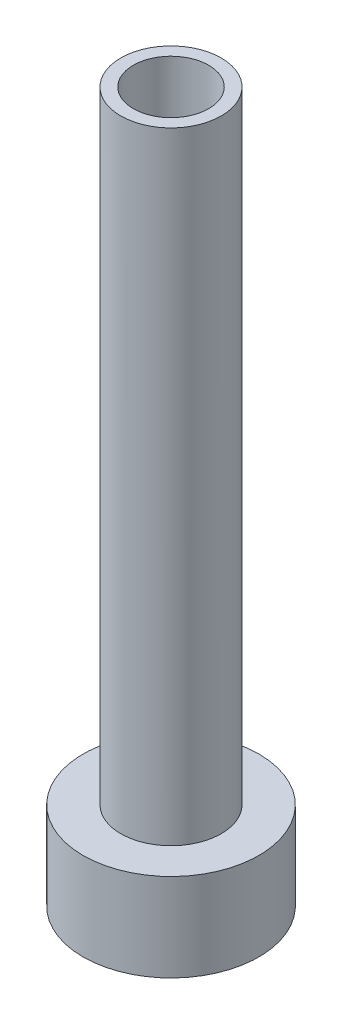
ISO-10303-21;
HEADER;
FILE_DESCRIPTION(('STEP AP214'),'2;1');
FILE_NAME('part.step','',(''),(''),'','','');
FILE_SCHEMA(('AUTOMOTIVE_DESIGN { 1 0 10303 214 1 1 1 1 }'));
ENDSEC;
DATA;
#1=APPLICATION_CONTEXT('core data for automotive mechanical design processes');
#2=APPLICATION_PROTOCOL_DEFINITION('international standard','automotive_design',2000,#1);
#3=PRODUCT_CONTEXT('',#1,'mechanical');
#4=PRODUCT('Part','Part','',(#3));
#5=PRODUCT_RELATED_PRODUCT_CATEGORY('part','',(#4));
#6=PRODUCT_DEFINITION_FORMATION('','',#4);
#7=PRODUCT_DEFINITION_CONTEXT('part definition',#1,'design');
#8=PRODUCT_DEFINITION('design','',#6,#7);
#9=PRODUCT_DEFINITION_SHAPE('','',#8);
#10=(LENGTH_UNIT() NAMED_UNIT(*) SI_UNIT(.MILLI.,.METRE.));
#11=(NAMED_UNIT(*) PLANE_ANGLE_UNIT() SI_UNIT($,.RADIAN.));
#12=(NAMED_UNIT(*) SI_UNIT($,.STERADIAN.) SOLID_ANGLE_UNIT());
#13=UNCERTAINTY_MEASURE_WITH_UNIT(LENGTH_MEASURE(1.E-05),#10,'distance_accuracy_value','');
#14=(GEOMETRIC_REPRESENTATION_CONTEXT(3) GLOBAL_UNCERTAINTY_ASSIGNED_CONTEXT((#13)) GLOBAL_UNIT_ASSIGNED_CONTEXT((#10,
#11,#12)) REPRESENTATION_CONTEXT('',''));
#15=CARTESIAN_POINT('',(0.,0.,0.));
#16=DIRECTION('',(0.,0.,1.));
#17=DIRECTION('',(1.,0.,0.));
#18=AXIS2_PLACEMENT_3D('',#15,#16,#17);
#19=CARTESIAN_POINT('',(0.,0.,0.));
#20=DIRECTION('',(0.,-1.,0.));
#21=DIRECTION('',(0.,0.,-1.));
#22=AXIS2_PLACEMENT_3D('',#19,#20,#21);
#23=CYLINDRICAL_SURFACE('',#22,4.);
#24=CARTESIAN_POINT('',(0.,7.,0.));
#25=DIRECTION('',(0.,-1.,0.));
#26=DIRECTION('',(0.,0.,-1.));
#27=AXIS2_PLACEMENT_3D('',#24,#25,#26);
#28=CIRCLE('',#27,4.);
#29=CARTESIAN_POINT('',(0.,7.,-4.));
#30=VERTEX_POINT('',#29);
#31=EDGE_CURVE('E53',#30,#30,#28,.T.);
#32=ORIENTED_EDGE('',*,*,#31,.F.);
#33=EDGE_LOOP('',(#32));
#34=FACE_BOUND('',#33,.T.);
#35=CARTESIAN_POINT('',(0.,56.5,0.));
#36=DIRECTION('',(0.,1.,0.));
#37=DIRECTION('',(0.,0.,1.));
#38=AXIS2_PLACEMENT_3D('',#35,#36,#37);
#39=CIRCLE('',#38,4.);
#40=CARTESIAN_POINT('',(0.,56.5,4.));
#41=VERTEX_POINT('',#40);
#42=EDGE_CURVE('E60',#41,#41,#39,.F.);
#43=ORIENTED_EDGE('',*,*,#42,.T.);
#44=EDGE_LOOP('',(#43));
#45=FACE_BOUND('',#44,.T.);
#46=ADVANCED_FACE('F31',(#34,#45),#23,.T.);
#47=CARTESIAN_POINT('',(0.,0.,0.));
#48=DIRECTION('',(0.,-1.,0.));
#49=DIRECTION('',(0.,0.,-1.));
#50=AXIS2_PLACEMENT_3D('',#47,#48,#49);
#51=CYLINDRICAL_SURFACE('',#50,3.);
#52=CARTESIAN_POINT('',(0.,29.,0.));
#53=DIRECTION('',(0.,1.,0.));
#54=DIRECTION('',(0.,0.,1.));
#55=AXIS2_PLACEMENT_3D('',#52,#53,#54);
#56=CIRCLE('',#55,3.);
#57=CARTESIAN_POINT('',(0.,29.,3.));
#58=VERTEX_POINT('',#57);
#59=EDGE_CURVE('E46',#58,#58,#56,.F.);
#60=ORIENTED_EDGE('',*,*,#59,.T.);
#61=EDGE_LOOP('',(#60));
#62=FACE_BOUND('',#61,.T.);
#63=CARTESIAN_POINT('',(0.,56.5,0.));
#64=DIRECTION('',(0.,1.,0.));
#65=DIRECTION('',(0.,0.,1.));
#66=AXIS2_PLACEMENT_3D('',#63,#64,#65);
#67=CIRCLE('',#66,3.);
#68=CARTESIAN_POINT('',(0.,56.5,3.));
#69=VERTEX_POINT('',#68);
#70=EDGE_CURVE('E35',#69,#69,#67,.F.);
#71=ORIENTED_EDGE('',*,*,#70,.F.);
#72=EDGE_LOOP('',(#71));
#73=FACE_BOUND('',#72,.T.);
#74=ADVANCED_FACE('F69',(#62,#73),#51,.F.);
#75=CARTESIAN_POINT('',(-2.99999999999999,0.,0.));
#76=DIRECTION('',(0.,1.,0.));
#77=DIRECTION('',(0.,0.,1.));
#78=AXIS2_PLACEMENT_3D('',#75,#76,#77);
#79=PLANE('',#78);
#80=CARTESIAN_POINT('',(0.,0.,0.));
#81=DIRECTION('',(0.,1.,0.));
#82=DIRECTION('',(0.,0.,1.));
#83=AXIS2_PLACEMENT_3D('',#80,#81,#82);
#84=CIRCLE('',#83,4.25000000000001);
#85=CARTESIAN_POINT('',(0.,0.,4.25000000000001));
#86=VERTEX_POINT('',#85);
#87=EDGE_CURVE('E39',#86,#86,#84,.T.);
#88=ORIENTED_EDGE('',*,*,#87,.T.);
#89=EDGE_LOOP('',(#88));
#90=FACE_BOUND('',#89,.T.);
#91=CARTESIAN_POINT('',(0.,0.,0.));
#92=DIRECTION('',(0.,-1.,0.));
#93=DIRECTION('',(0.,0.,-1.));
#94=AXIS2_PLACEMENT_3D('',#91,#92,#93);
#95=CIRCLE('',#94,7.);
#96=CARTESIAN_POINT('',(0.,0.,-7.));
#97=VERTEX_POINT('',#96);
#98=EDGE_CURVE('E49',#97,#97,#95,.T.);
#99=ORIENTED_EDGE('',*,*,#98,.T.);
#100=EDGE_LOOP('',(#99));
#101=FACE_BOUND('',#100,.T.);
#102=ADVANCED_FACE('F71',(#90,#101),#79,.F.);
#103=CARTESIAN_POINT('',(0.,0.,0.));
#104=DIRECTION('',(0.,-1.,0.));
#105=DIRECTION('',(0.,0.,-1.));
#106=AXIS2_PLACEMENT_3D('',#103,#104,#105);
#107=CYLINDRICAL_SURFACE('',#106,7.);
#108=ORIENTED_EDGE('',*,*,#98,.F.);
#109=EDGE_LOOP('',(#108));
#110=FACE_BOUND('',#109,.T.);
#111=CARTESIAN_POINT('',(0.,7.,0.));
#112=DIRECTION('',(0.,-1.,0.));
#113=DIRECTION('',(0.,0.,-1.));
#114=AXIS2_PLACEMENT_3D('',#111,#112,#113);
#115=CIRCLE('',#114,7.);
#116=CARTESIAN_POINT('',(0.,7.,-7.));
#117=VERTEX_POINT('',#116);
#118=EDGE_CURVE('E43',#117,#117,#115,.T.);
#119=ORIENTED_EDGE('',*,*,#118,.T.);
#120=EDGE_LOOP('',(#119));
#121=FACE_BOUND('',#120,.T.);
#122=ADVANCED_FACE('F78',(#110,#121),#107,.T.);
#123=CARTESIAN_POINT('',(-7.,7.,0.));
#124=DIRECTION('',(0.,-1.,0.));
#125=DIRECTION('',(0.,0.,-1.));
#126=AXIS2_PLACEMENT_3D('',#123,#124,#125);
#127=PLANE('',#126);
#128=ORIENTED_EDGE('',*,*,#118,.F.);
#129=EDGE_LOOP('',(#128));
#130=FACE_BOUND('',#129,.T.);
#131=ORIENTED_EDGE('',*,*,#31,.T.);
#132=EDGE_LOOP('',(#131));
#133=FACE_BOUND('',#132,.T.);
#134=ADVANCED_FACE('F85',(#130,#133),#127,.F.);
#135=CARTESIAN_POINT('',(0.,29.,0.));
#136=DIRECTION('',(0.,1.,0.));
#137=DIRECTION('',(0.,0.,1.));
#138=AXIS2_PLACEMENT_3D('',#135,#136,#137);
#139=PLANE('',#138);
#140=CARTESIAN_POINT('',(0.,29.,0.));
#141=DIRECTION('',(0.,1.,0.));
#142=DIRECTION('',(0.,0.,1.));
#143=AXIS2_PLACEMENT_3D('',#140,#141,#142);
#144=CIRCLE('',#143,3.25);
#145=CARTESIAN_POINT('',(0.,29.,-3.25));
#146=VERTEX_POINT('',#145);
#147=EDGE_CURVE('E50',#146,#146,#144,.T.);
#148=ORIENTED_EDGE('',*,*,#147,.F.);
#149=EDGE_LOOP('',(#148));
#150=FACE_BOUND('',#149,.T.);
#151=ORIENTED_EDGE('',*,*,#59,.F.);
#152=EDGE_LOOP('',(#151));
#153=FACE_BOUND('',#152,.T.);
#154=ADVANCED_FACE('F87',(#150,#153),#139,.F.);
#155=CARTESIAN_POINT('',(0.,29.,0.));
#156=DIRECTION('',(0.,-1.,0.));
#157=DIRECTION('',(0.,0.,-1.));
#158=AXIS2_PLACEMENT_3D('',#155,#156,#157);
#159=CYLINDRICAL_SURFACE('',#158,3.25);
#160=CARTESIAN_POINT('',(0.,1.00000000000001,0.));
#161=DIRECTION('',(0.,1.,0.));
#162=DIRECTION('',(0.,0.,1.));
#163=AXIS2_PLACEMENT_3D('',#160,#161,#162);
#164=CIRCLE('',#163,3.25);
#165=CARTESIAN_POINT('',(0.,1.00000000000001,-3.25));
#166=VERTEX_POINT('',#165);
#167=EDGE_CURVE('E10',#166,#166,#164,.F.);
#168=CARTESIAN_POINT('',(0.,1.00000000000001,-3.25));
#169=CARTESIAN_POINT('',(0.,1.29166666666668,-3.25));
#170=CARTESIAN_POINT('',(0.,1.58333333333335,-3.25));
#171=CARTESIAN_POINT('',(0.,2.16666666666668,-3.25));
#172=CARTESIAN_POINT('',(0.,2.45833333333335,-3.25));
#173=CARTESIAN_POINT('',(0.,3.04166666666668,-3.25));
#174=CARTESIAN_POINT('',(0.,3.33333333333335,-3.25));
#175=CARTESIAN_POINT('',(0.,3.91666666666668,-3.25));
#176=CARTESIAN_POINT('',(0.,4.20833333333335,-3.25));
#177=CARTESIAN_POINT('',(0.,4.79166666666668,-3.25));
#178=CARTESIAN_POINT('',(0.,5.08333333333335,-3.25));
#179=CARTESIAN_POINT('',(0.,5.66666666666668,-3.25));
#180=CARTESIAN_POINT('',(0.,5.95833333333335,-3.25));
#181=CARTESIAN_POINT('',(0.,6.54166666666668,-3.25));
#182=CARTESIAN_POINT('',(0.,6.83333333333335,-3.25));
#183=CARTESIAN_POINT('',(0.,7.41666666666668,-3.25));
#184=CARTESIAN_POINT('',(0.,7.70833333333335,-3.25));
#185=CARTESIAN_POINT('',(0.,8.29166666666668,-3.25));
#186=CARTESIAN_POINT('',(0.,8.58333333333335,-3.25));
#187=CARTESIAN_POINT('',(0.,9.16666666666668,-3.25));
#188=CARTESIAN_POINT('',(0.,9.45833333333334,-3.25));
#189=CARTESIAN_POINT('',(0.,10.0416666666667,-3.25));
#190=CARTESIAN_POINT('',(0.,10.3333333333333,-3.25));
#191=CARTESIAN_POINT('',(0.,10.9166666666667,-3.25));
#192=CARTESIAN_POINT('',(0.,11.2083333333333,-3.25));
#193=CARTESIAN_POINT('',(0.,11.7916666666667,-3.25));
#194=CARTESIAN_POINT('',(0.,12.0833333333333,-3.25));
#195=CARTESIAN_POINT('',(0.,12.6666666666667,-3.25));
#196=CARTESIAN_POINT('',(0.,12.9583333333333,-3.25));
#197=CARTESIAN_POINT('',(0.,13.5416666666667,-3.25));
#198=CARTESIAN_POINT('',(0.,13.8333333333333,-3.25));
#199=CARTESIAN_POINT('',(0.,14.4166666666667,-3.25));
#200=CARTESIAN_POINT('',(0.,14.7083333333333,-3.25));
#201=CARTESIAN_POINT('',(0.,15.2916666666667,-3.25));
#202=CARTESIAN_POINT('',(0.,15.5833333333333,-3.25));
#203=CARTESIAN_POINT('',(0.,16.1666666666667,-3.25));
#204=CARTESIAN_POINT('',(0.,16.4583333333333,-3.25));
#205=CARTESIAN_POINT('',(0.,17.0416666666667,-3.25));
#206=CARTESIAN_POINT('',(0.,17.3333333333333,-3.25));
#207=CARTESIAN_POINT('',(0.,17.9166666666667,-3.25));
#208=CARTESIAN_POINT('',(0.,18.2083333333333,-3.25));
#209=CARTESIAN_POINT('',(0.,18.7916666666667,-3.25));
#210=CARTESIAN_POINT('',(0.,19.0833333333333,-3.25));
#211=CARTESIAN_POINT('',(0.,19.6666666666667,-3.25));
#212=CARTESIAN_POINT('',(0.,19.9583333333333,-3.25));
#213=CARTESIAN_POINT('',(0.,20.5416666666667,-3.25));
#214=CARTESIAN_POINT('',(0.,20.8333333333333,-3.25));
#215=CARTESIAN_POINT('',(0.,21.4166666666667,-3.25));
#216=CARTESIAN_POINT('',(0.,21.7083333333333,-3.25));
#217=CARTESIAN_POINT('',(0.,22.2916666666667,-3.25));
#218=CARTESIAN_POINT('',(0.,22.5833333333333,-3.25));
#219=CARTESIAN_POINT('',(0.,23.1666666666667,-3.25));
#220=CARTESIAN_POINT('',(0.,23.4583333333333,-3.25));
#221=CARTESIAN_POINT('',(0.,24.0416666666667,-3.25));
#222=CARTESIAN_POINT('',(0.,24.3333333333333,-3.25));
#223=CARTESIAN_POINT('',(0.,24.9166666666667,-3.25));
#224=CARTESIAN_POINT('',(0.,25.2083333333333,-3.25));
#225=CARTESIAN_POINT('',(0.,25.7916666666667,-3.25));
#226=CARTESIAN_POINT('',(0.,26.0833333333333,-3.25));
#227=CARTESIAN_POINT('',(0.,26.6666666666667,-3.25));
#228=CARTESIAN_POINT('',(0.,26.9583333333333,-3.25));
#229=CARTESIAN_POINT('',(0.,27.5416666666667,-3.25));
#230=CARTESIAN_POINT('',(0.,27.8333333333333,-3.25));
#231=CARTESIAN_POINT('',(0.,28.4166666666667,-3.25));
#232=CARTESIAN_POINT('',(0.,28.7083333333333,-3.25));
#233=CARTESIAN_POINT('',(0.,29.,-3.25));
#234=B_SPLINE_CURVE_WITH_KNOTS('',3,(#168,#169,#170,#171,#172,#173,#174,#175,#176,#177,#178,
#179,#180,#181,#182,#183,#184,#185,#186,#187,#188,#189,#190,#191,#192,#193,#194,#195,#196,#197,
#198,#199,#200,#201,#202,#203,#204,#205,#206,#207,#208,#209,#210,#211,#212,#213,#214,#215,#216,
#217,#218,#219,#220,#221,#222,#223,#224,#225,#226,#227,#228,#229,#230,#231,#232,#233),
.UNSPECIFIED.,.F.,.F.,(4,2,2,2,2,2,2,2,2,2,2,2,2,2,2,2,2,2,2,2,2,2,2,2,2,2,2,2,2,2,2,2,4),(0.,
0.875000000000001,1.75,2.625,3.5,4.375,5.25,6.125,7.,7.875,8.75,9.62499999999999,10.5,11.375,
12.25,13.125,14.,14.875,15.75,16.625,17.5,18.375,19.25,20.125,21.,21.875,22.75,23.625,24.5,
25.375,26.25,27.125,28.),.UNSPECIFIED.);
#235=EDGE_CURVE('BSEAM111',#166,#146,#234,.T.);
#236=ORIENTED_EDGE('',*,*,#167,.T.);
#237=ORIENTED_EDGE('',*,*,#147,.T.);
#238=ORIENTED_EDGE('',*,*,#235,.T.);
#239=ORIENTED_EDGE('',*,*,#235,.F.);
#240=EDGE_LOOP('',(#236,#238,#237,#239));
#241=FACE_BOUND('',#240,.T.);
#242=ADVANCED_FACE('F111',(#241),#159,.F.);
#243=CARTESIAN_POINT('',(0.,0.,0.));
#244=DIRECTION('',(0.,-1.,0.));
#245=DIRECTION('',(0.,0.,-1.));
#246=AXIS2_PLACEMENT_3D('',#243,#244,#245);
#247=CONICAL_SURFACE('',#246,4.25000000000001,0.785398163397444);
#248=ORIENTED_EDGE('',*,*,#167,.F.);
#249=EDGE_LOOP('',(#248));
#250=FACE_BOUND('',#249,.T.);
#251=ORIENTED_EDGE('',*,*,#87,.F.);
#252=EDGE_LOOP('',(#251));
#253=FACE_BOUND('',#252,.T.);
#254=ADVANCED_FACE('F33',(#250,#253),#247,.F.);
#255=CARTESIAN_POINT('',(-0.342280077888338,56.5,-3.98532863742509));
#256=DIRECTION('',(0.,1.,0.));
#257=DIRECTION('',(-0.996332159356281,0.,0.0855700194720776));
#258=AXIS2_PLACEMENT_3D('',#255,#256,#257);
#259=PLANE('',#258);
#260=ORIENTED_EDGE('',*,*,#42,.F.);
#261=EDGE_LOOP('',(#260));
#262=FACE_BOUND('',#261,.T.);
#263=ORIENTED_EDGE('',*,*,#70,.T.);
#264=EDGE_LOOP('',(#263));
#265=FACE_BOUND('',#264,.T.);
#266=ADVANCED_FACE('F67',(#262,#265),#259,.T.);
#267=CLOSED_SHELL('',(#46,#74,#102,#122,#134,#154,#242,#254,#266));
#268=MANIFOLD_SOLID_BREP('B2',#267);
#269=ADVANCED_BREP_SHAPE_REPRESENTATION('',(#18,#268),#14);
#270=SHAPE_DEFINITION_REPRESENTATION(#9,#269);
ENDSEC;
END-ISO-10303-21;
